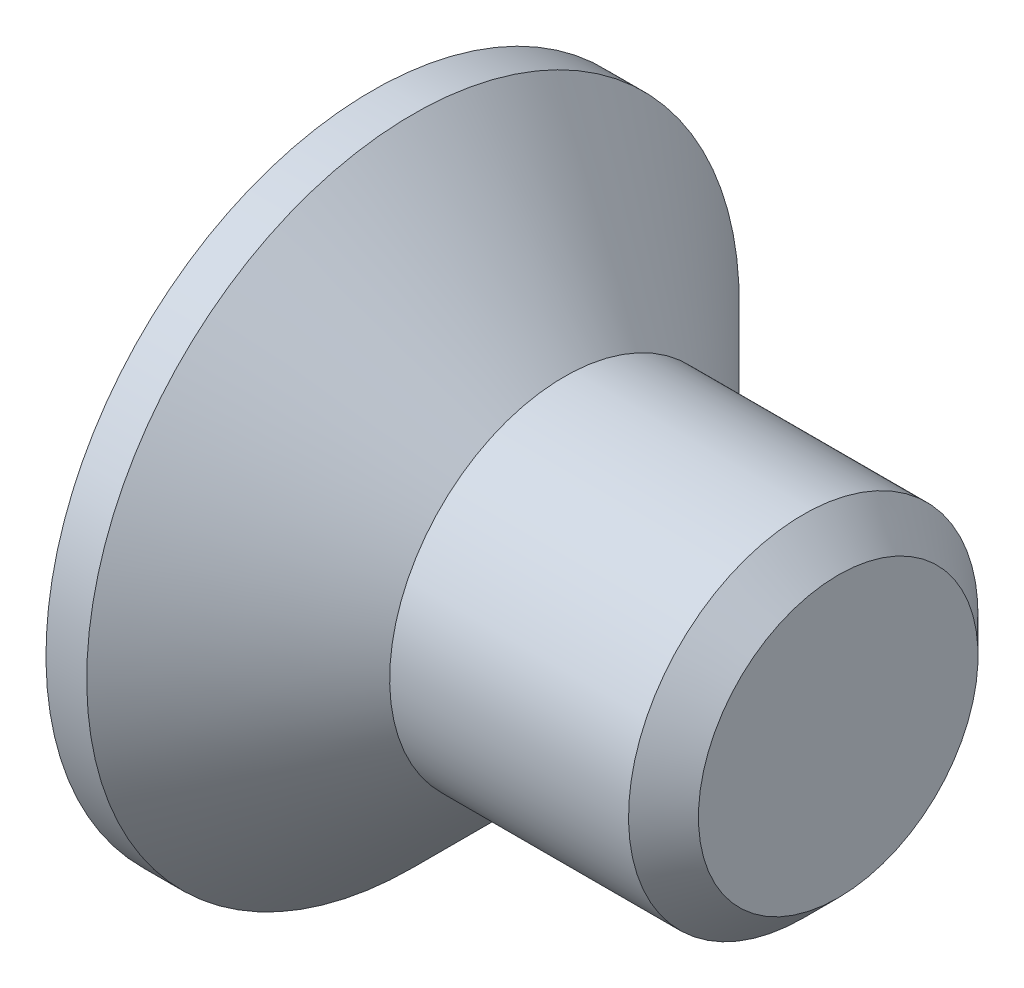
from build123d import *

# Parameters (mm, degrees)
CHAMFER1_SIZE      = 0.3
CUT_EXTRUDE1_DEPTH = 1.25


with BuildPart() as part:
    # Sketch1 → Revolve1 (revolve)
    with BuildSketch(Plane.XY, mode=Mode.PRIVATE) as revolve1_sk:
        Polygon((-1.65, 2.8), (-1.65, 0), (2.35, 0), (2.35, 1.5), (0, 1.5), (-1.3, 2.8), align=None)
    revolve(revolve1_sk.sketch.rotate(Axis((-1.65, 0, 0), (1, 0, 0)), 180), axis=Axis((-1.65, 0, 0), (1, 0, 0)))

    # Chamfer1
    chamfer1_edges = [part.edges().sort_by_distance(p)[0] for p in [
        (2.35, 1.5, 0),
    ]]
    chamfer(chamfer1_edges, length=CHAMFER1_SIZE)

    # Sketch2 → Cut-Extrude1 (cut)
    with BuildSketch(Plane.ZY.offset(1.65)):
        Polygon((-0.365, 1.45), (0.365, 1.45), (0.365, 0.365), (1.45, 0.365), (1.45, -0.365), (0.365, -0.365), (0.365, -1.45), (-0.365, -1.45), (-0.365, -0.365), (-1.45, -0.365), (-1.45, 0.365), (-0.365, 0.365), align=None)
    extrude(amount=-CUT_EXTRUDE1_DEPTH, mode=Mode.SUBTRACT)


solid = part.part
